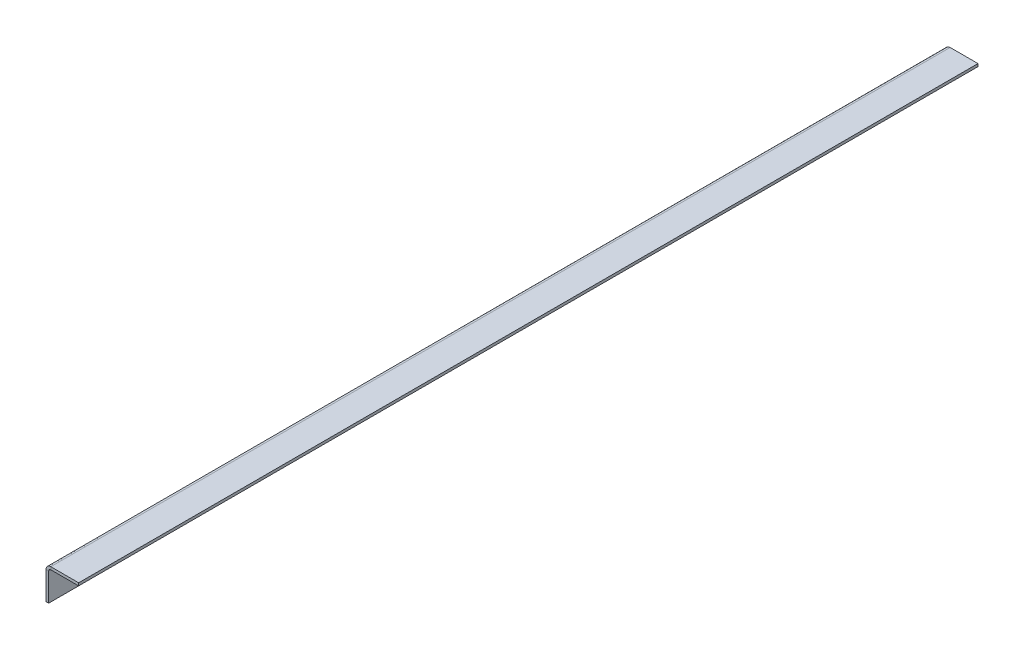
ISO-10303-21;
HEADER;
FILE_DESCRIPTION(('STEP AP214'),'2;1');
FILE_NAME('part.step','',(''),(''),'','','');
FILE_SCHEMA(('AUTOMOTIVE_DESIGN { 1 0 10303 214 1 1 1 1 }'));
ENDSEC;
DATA;
#1=APPLICATION_CONTEXT('core data for automotive mechanical design processes');
#2=APPLICATION_PROTOCOL_DEFINITION('international standard','automotive_design',2000,#1);
#3=PRODUCT_CONTEXT('',#1,'mechanical');
#4=PRODUCT('Part','Part','',(#3));
#5=PRODUCT_RELATED_PRODUCT_CATEGORY('part','',(#4));
#6=PRODUCT_DEFINITION_FORMATION('','',#4);
#7=PRODUCT_DEFINITION_CONTEXT('part definition',#1,'design');
#8=PRODUCT_DEFINITION('design','',#6,#7);
#9=PRODUCT_DEFINITION_SHAPE('','',#8);
#10=(LENGTH_UNIT() NAMED_UNIT(*) SI_UNIT(.MILLI.,.METRE.));
#11=(NAMED_UNIT(*) PLANE_ANGLE_UNIT() SI_UNIT($,.RADIAN.));
#12=(NAMED_UNIT(*) SI_UNIT($,.STERADIAN.) SOLID_ANGLE_UNIT());
#13=UNCERTAINTY_MEASURE_WITH_UNIT(LENGTH_MEASURE(1.E-05),#10,'distance_accuracy_value','');
#14=(GEOMETRIC_REPRESENTATION_CONTEXT(3) GLOBAL_UNCERTAINTY_ASSIGNED_CONTEXT((#13)) GLOBAL_UNIT_ASSIGNED_CONTEXT((#10,
#11,#12)) REPRESENTATION_CONTEXT('',''));
#15=CARTESIAN_POINT('',(0.,0.,0.));
#16=DIRECTION('',(0.,0.,1.));
#17=DIRECTION('',(1.,0.,0.));
#18=AXIS2_PLACEMENT_3D('',#15,#16,#17);
#19=CARTESIAN_POINT('',(0.,47.2186,762.));
#20=DIRECTION('',(0.,0.,1.));
#21=DIRECTION('',(1.,0.,0.));
#22=AXIS2_PLACEMENT_3D('',#19,#20,#21);
#23=PLANE('',#22);
#24=DIRECTION('',(-1.,0.,0.));
#25=VECTOR('',#24,1.);
#26=CARTESIAN_POINT('',(0.,47.2186,762.));
#27=LINE('',#26,#25);
#28=CARTESIAN_POINT('',(0.,47.2186,762.));
#29=VERTEX_POINT('',#28);
#30=CARTESIAN_POINT('',(-4.5466,47.2186,762.));
#31=VERTEX_POINT('',#30);
#32=EDGE_CURVE('E11',#29,#31,#27,.T.);
#33=ORIENTED_EDGE('',*,*,#32,.F.);
#34=CARTESIAN_POINT('',(3.5814,47.2186,762.));
#35=DIRECTION('',(0.,0.,1.));
#36=DIRECTION('',(1.,0.,0.));
#37=AXIS2_PLACEMENT_3D('',#34,#35,#36);
#38=CIRCLE('',#37,3.5814);
#39=CARTESIAN_POINT('',(3.5814,50.8,762.));
#40=VERTEX_POINT('',#39);
#41=EDGE_CURVE('E129',#29,#40,#38,.F.);
#42=ORIENTED_EDGE('',*,*,#41,.T.);
#43=DIRECTION('',(0.,-1.,0.));
#44=VECTOR('',#43,1.);
#45=CARTESIAN_POINT('',(3.5814,55.3466,762.));
#46=LINE('',#45,#44);
#47=CARTESIAN_POINT('',(3.5814,55.3466,762.));
#48=VERTEX_POINT('',#47);
#49=EDGE_CURVE('E47',#48,#40,#46,.T.);
#50=ORIENTED_EDGE('',*,*,#49,.F.);
#51=CARTESIAN_POINT('',(3.5814,47.2186,762.));
#52=DIRECTION('',(0.,0.,1.));
#53=DIRECTION('',(1.,0.,0.));
#54=AXIS2_PLACEMENT_3D('',#51,#52,#53);
#55=CIRCLE('',#54,8.128);
#56=EDGE_CURVE('E136',#31,#48,#55,.F.);
#57=ORIENTED_EDGE('',*,*,#56,.F.);
#58=EDGE_LOOP('',(#33,#42,#50,#57));
#59=FACE_BOUND('',#58,.T.);
#60=ADVANCED_FACE('F39',(#59),#23,.T.);
#61=CARTESIAN_POINT('',(3.5814,55.3466,762.));
#62=DIRECTION('',(0.,0.,1.));
#63=DIRECTION('',(1.,0.,0.));
#64=AXIS2_PLACEMENT_3D('',#61,#62,#63);
#65=PLANE('',#64);
#66=DIRECTION('',(0.,1.,0.));
#67=VECTOR('',#66,1.);
#68=CARTESIAN_POINT('',(0.,0.,762.));
#69=LINE('',#68,#67);
#70=CARTESIAN_POINT('',(0.,0.,762.));
#71=VERTEX_POINT('',#70);
#72=EDGE_CURVE('E124',#71,#29,#69,.T.);
#73=ORIENTED_EDGE('',*,*,#72,.T.);
#74=ORIENTED_EDGE('',*,*,#32,.T.);
#75=DIRECTION('',(0.,1.,0.));
#76=VECTOR('',#75,1.);
#77=CARTESIAN_POINT('',(-4.5466,0.,762.));
#78=LINE('',#77,#76);
#79=CARTESIAN_POINT('',(-4.5466,0.,762.));
#80=VERTEX_POINT('',#79);
#81=EDGE_CURVE('E134',#80,#31,#78,.T.);
#82=ORIENTED_EDGE('',*,*,#81,.F.);
#83=DIRECTION('',(-1.,0.,0.));
#84=VECTOR('',#83,1.);
#85=CARTESIAN_POINT('',(0.,0.,762.));
#86=LINE('',#85,#84);
#87=EDGE_CURVE('E115',#71,#80,#86,.T.);
#88=ORIENTED_EDGE('',*,*,#87,.F.);
#89=EDGE_LOOP('',(#73,#74,#82,#88));
#90=FACE_BOUND('',#89,.T.);
#91=ADVANCED_FACE('F132',(#90),#65,.T.);
#92=CARTESIAN_POINT('',(3.5814,50.8,-762.));
#93=DIRECTION('',(0.,0.,-1.));
#94=DIRECTION('',(-1.,0.,0.));
#95=AXIS2_PLACEMENT_3D('',#92,#93,#94);
#96=PLANE('',#95);
#97=DIRECTION('',(0.,1.,0.));
#98=VECTOR('',#97,1.);
#99=CARTESIAN_POINT('',(3.5814,50.8,-762.));
#100=LINE('',#99,#98);
#101=CARTESIAN_POINT('',(3.5814,50.8,-762.));
#102=VERTEX_POINT('',#101);
#103=CARTESIAN_POINT('',(3.5814,55.3466,-762.));
#104=VERTEX_POINT('',#103);
#105=EDGE_CURVE('E90',#102,#104,#100,.T.);
#106=ORIENTED_EDGE('',*,*,#105,.F.);
#107=CARTESIAN_POINT('',(3.5814,47.2186,-762.));
#108=DIRECTION('',(0.,0.,1.));
#109=DIRECTION('',(1.,0.,0.));
#110=AXIS2_PLACEMENT_3D('',#107,#108,#109);
#111=CIRCLE('',#110,3.5814);
#112=CARTESIAN_POINT('',(0.,47.2186,-762.));
#113=VERTEX_POINT('',#112);
#114=EDGE_CURVE('E158',#113,#102,#111,.F.);
#115=ORIENTED_EDGE('',*,*,#114,.F.);
#116=DIRECTION('',(1.,0.,0.));
#117=VECTOR('',#116,1.);
#118=CARTESIAN_POINT('',(-4.5466,47.2186,-762.));
#119=LINE('',#118,#117);
#120=CARTESIAN_POINT('',(-4.5466,47.2186,-762.));
#121=VERTEX_POINT('',#120);
#122=EDGE_CURVE('E83',#121,#113,#119,.T.);
#123=ORIENTED_EDGE('',*,*,#122,.F.);
#124=CARTESIAN_POINT('',(3.5814,47.2186,-762.));
#125=DIRECTION('',(0.,0.,1.));
#126=DIRECTION('',(1.,0.,0.));
#127=AXIS2_PLACEMENT_3D('',#124,#125,#126);
#128=CIRCLE('',#127,8.128);
#129=EDGE_CURVE('E151',#121,#104,#128,.F.);
#130=ORIENTED_EDGE('',*,*,#129,.T.);
#131=EDGE_LOOP('',(#106,#115,#123,#130));
#132=FACE_BOUND('',#131,.T.);
#133=ADVANCED_FACE('F190',(#132),#96,.T.);
#134=CARTESIAN_POINT('',(-4.5466,47.2186,-762.));
#135=DIRECTION('',(0.,0.,-1.));
#136=DIRECTION('',(-1.,0.,0.));
#137=AXIS2_PLACEMENT_3D('',#134,#135,#136);
#138=PLANE('',#137);
#139=DIRECTION('',(1.,0.,0.));
#140=VECTOR('',#139,1.);
#141=CARTESIAN_POINT('',(0.,50.8,-762.));
#142=LINE('',#141,#140);
#143=CARTESIAN_POINT('',(50.8,50.8,-762.));
#144=VERTEX_POINT('',#143);
#145=EDGE_CURVE('E142',#102,#144,#142,.T.);
#146=ORIENTED_EDGE('',*,*,#145,.F.);
#147=ORIENTED_EDGE('',*,*,#105,.T.);
#148=DIRECTION('',(1.,0.,0.));
#149=VECTOR('',#148,1.);
#150=CARTESIAN_POINT('',(0.,55.3466,-762.));
#151=LINE('',#150,#149);
#152=CARTESIAN_POINT('',(50.8,55.3466,-762.));
#153=VERTEX_POINT('',#152);
#154=EDGE_CURVE('E148',#104,#153,#151,.T.);
#155=ORIENTED_EDGE('',*,*,#154,.T.);
#156=DIRECTION('',(0.,-1.,0.));
#157=VECTOR('',#156,1.);
#158=CARTESIAN_POINT('',(50.8,55.3466,-762.));
#159=LINE('',#158,#157);
#160=EDGE_CURVE('E145',#153,#144,#159,.T.);
#161=ORIENTED_EDGE('',*,*,#160,.T.);
#162=EDGE_LOOP('',(#146,#147,#155,#161));
#163=FACE_BOUND('',#162,.T.);
#164=ADVANCED_FACE('F177',(#163),#138,.T.);
#165=CARTESIAN_POINT('',(0.,50.8,762.));
#166=DIRECTION('',(0.,1.,0.));
#167=DIRECTION('',(0.,0.,1.));
#168=AXIS2_PLACEMENT_3D('',#165,#166,#167);
#169=PLANE('',#168);
#170=ORIENTED_EDGE('',*,*,#145,.T.);
#171=DIRECTION('',(0.,0.,-1.));
#172=VECTOR('',#171,1.);
#173=CARTESIAN_POINT('',(50.8,50.8,762.));
#174=LINE('',#173,#172);
#175=CARTESIAN_POINT('',(50.8,50.8,762.));
#176=VERTEX_POINT('',#175);
#177=EDGE_CURVE('E172',#176,#144,#174,.T.);
#178=ORIENTED_EDGE('',*,*,#177,.F.);
#179=DIRECTION('',(1.,0.,0.));
#180=VECTOR('',#179,1.);
#181=CARTESIAN_POINT('',(0.,50.8,762.));
#182=LINE('',#181,#180);
#183=EDGE_CURVE('E96',#40,#176,#182,.T.);
#184=ORIENTED_EDGE('',*,*,#183,.F.);
#185=DIRECTION('',(0.,0.,-1.));
#186=VECTOR('',#185,1.);
#187=CARTESIAN_POINT('',(3.5814,50.8,762.));
#188=LINE('',#187,#186);
#189=EDGE_CURVE('E141',#40,#102,#188,.T.);
#190=ORIENTED_EDGE('',*,*,#189,.T.);
#191=EDGE_LOOP('',(#170,#178,#184,#190));
#192=FACE_BOUND('',#191,.T.);
#193=ADVANCED_FACE('F226',(#192),#169,.F.);
#194=CARTESIAN_POINT('',(50.8,55.3466,762.));
#195=DIRECTION('',(1.,0.,0.));
#196=DIRECTION('',(0.,0.,-1.));
#197=AXIS2_PLACEMENT_3D('',#194,#195,#196);
#198=PLANE('',#197);
#199=ORIENTED_EDGE('',*,*,#160,.F.);
#200=DIRECTION('',(0.,0.,-1.));
#201=VECTOR('',#200,1.);
#202=CARTESIAN_POINT('',(50.8,55.3466,762.));
#203=LINE('',#202,#201);
#204=CARTESIAN_POINT('',(50.8,55.3466,762.));
#205=VERTEX_POINT('',#204);
#206=EDGE_CURVE('E170',#205,#153,#203,.T.);
#207=ORIENTED_EDGE('',*,*,#206,.F.);
#208=DIRECTION('',(0.,-1.,0.));
#209=VECTOR('',#208,1.);
#210=CARTESIAN_POINT('',(50.8,55.3466,762.));
#211=LINE('',#210,#209);
#212=EDGE_CURVE('E196',#205,#176,#211,.T.);
#213=ORIENTED_EDGE('',*,*,#212,.T.);
#214=ORIENTED_EDGE('',*,*,#177,.T.);
#215=EDGE_LOOP('',(#199,#207,#213,#214));
#216=FACE_BOUND('',#215,.T.);
#217=ADVANCED_FACE('F202',(#216),#198,.T.);
#218=CARTESIAN_POINT('',(0.,55.3466,762.));
#219=DIRECTION('',(0.,1.,0.));
#220=DIRECTION('',(0.,0.,1.));
#221=AXIS2_PLACEMENT_3D('',#218,#219,#220);
#222=PLANE('',#221);
#223=ORIENTED_EDGE('',*,*,#154,.F.);
#224=DIRECTION('',(0.,0.,-1.));
#225=VECTOR('',#224,1.);
#226=CARTESIAN_POINT('',(3.5814,55.3466,762.));
#227=LINE('',#226,#225);
#228=EDGE_CURVE('E167',#48,#104,#227,.T.);
#229=ORIENTED_EDGE('',*,*,#228,.F.);
#230=DIRECTION('',(1.,0.,0.));
#231=VECTOR('',#230,1.);
#232=CARTESIAN_POINT('',(0.,55.3466,762.));
#233=LINE('',#232,#231);
#234=EDGE_CURVE('E195',#48,#205,#233,.T.);
#235=ORIENTED_EDGE('',*,*,#234,.T.);
#236=ORIENTED_EDGE('',*,*,#206,.T.);
#237=EDGE_LOOP('',(#223,#229,#235,#236));
#238=FACE_BOUND('',#237,.T.);
#239=ADVANCED_FACE('F188',(#238),#222,.T.);
#240=CARTESIAN_POINT('',(3.5814,47.2186,762.));
#241=DIRECTION('',(0.,0.,-1.));
#242=DIRECTION('',(-1.,0.,0.));
#243=AXIS2_PLACEMENT_3D('',#240,#241,#242);
#244=CYLINDRICAL_SURFACE('',#243,8.128);
#245=ORIENTED_EDGE('',*,*,#129,.F.);
#246=DIRECTION('',(0.,0.,-1.));
#247=VECTOR('',#246,1.);
#248=CARTESIAN_POINT('',(-4.5466,47.2186,762.));
#249=LINE('',#248,#247);
#250=EDGE_CURVE('E164',#31,#121,#249,.T.);
#251=ORIENTED_EDGE('',*,*,#250,.F.);
#252=ORIENTED_EDGE('',*,*,#56,.T.);
#253=ORIENTED_EDGE('',*,*,#228,.T.);
#254=EDGE_LOOP('',(#245,#251,#252,#253));
#255=FACE_BOUND('',#254,.T.);
#256=ADVANCED_FACE('F183',(#255),#244,.T.);
#257=CARTESIAN_POINT('',(-4.5466,0.,762.));
#258=DIRECTION('',(-1.,0.,0.));
#259=DIRECTION('',(0.,0.,1.));
#260=AXIS2_PLACEMENT_3D('',#257,#258,#259);
#261=PLANE('',#260);
#262=DIRECTION('',(0.,1.,0.));
#263=VECTOR('',#262,1.);
#264=CARTESIAN_POINT('',(-4.5466,0.,-762.));
#265=LINE('',#264,#263);
#266=CARTESIAN_POINT('',(-4.5466,0.,-762.));
#267=VERTEX_POINT('',#266);
#268=EDGE_CURVE('E153',#267,#121,#265,.T.);
#269=ORIENTED_EDGE('',*,*,#268,.F.);
#270=DIRECTION('',(0.,0.,-1.));
#271=VECTOR('',#270,1.);
#272=CARTESIAN_POINT('',(-4.5466,0.,762.));
#273=LINE('',#272,#271);
#274=EDGE_CURVE('E119',#80,#267,#273,.T.);
#275=ORIENTED_EDGE('',*,*,#274,.F.);
#276=ORIENTED_EDGE('',*,*,#81,.T.);
#277=ORIENTED_EDGE('',*,*,#250,.T.);
#278=EDGE_LOOP('',(#269,#275,#276,#277));
#279=FACE_BOUND('',#278,.T.);
#280=ADVANCED_FACE('F193',(#279),#261,.T.);
#281=CARTESIAN_POINT('',(0.,0.,762.));
#282=DIRECTION('',(0.,-1.,0.));
#283=DIRECTION('',(0.,0.,-1.));
#284=AXIS2_PLACEMENT_3D('',#281,#282,#283);
#285=PLANE('',#284);
#286=DIRECTION('',(-1.,0.,0.));
#287=VECTOR('',#286,1.);
#288=CARTESIAN_POINT('',(0.,0.,-762.));
#289=LINE('',#288,#287);
#290=CARTESIAN_POINT('',(0.,0.,-762.));
#291=VERTEX_POINT('',#290);
#292=EDGE_CURVE('E117',#291,#267,#289,.T.);
#293=ORIENTED_EDGE('',*,*,#292,.F.);
#294=DIRECTION('',(0.,0.,-1.));
#295=VECTOR('',#294,1.);
#296=CARTESIAN_POINT('',(0.,0.,762.));
#297=LINE('',#296,#295);
#298=EDGE_CURVE('E111',#71,#291,#297,.T.);
#299=ORIENTED_EDGE('',*,*,#298,.F.);
#300=ORIENTED_EDGE('',*,*,#87,.T.);
#301=ORIENTED_EDGE('',*,*,#274,.T.);
#302=EDGE_LOOP('',(#293,#299,#300,#301));
#303=FACE_BOUND('',#302,.T.);
#304=ADVANCED_FACE('F113',(#303),#285,.T.);
#305=CARTESIAN_POINT('',(0.,0.,762.));
#306=DIRECTION('',(-1.,0.,0.));
#307=DIRECTION('',(0.,0.,1.));
#308=AXIS2_PLACEMENT_3D('',#305,#306,#307);
#309=PLANE('',#308);
#310=DIRECTION('',(0.,1.,0.));
#311=VECTOR('',#310,1.);
#312=CARTESIAN_POINT('',(0.,0.,-762.));
#313=LINE('',#312,#311);
#314=EDGE_CURVE('E156',#291,#113,#313,.T.);
#315=ORIENTED_EDGE('',*,*,#314,.T.);
#316=DIRECTION('',(0.,0.,-1.));
#317=VECTOR('',#316,1.);
#318=CARTESIAN_POINT('',(0.,47.2186,762.));
#319=LINE('',#318,#317);
#320=EDGE_CURVE('E120',#29,#113,#319,.T.);
#321=ORIENTED_EDGE('',*,*,#320,.F.);
#322=ORIENTED_EDGE('',*,*,#72,.F.);
#323=ORIENTED_EDGE('',*,*,#298,.T.);
#324=EDGE_LOOP('',(#315,#321,#322,#323));
#325=FACE_BOUND('',#324,.T.);
#326=ADVANCED_FACE('F125',(#325),#309,.F.);
#327=CARTESIAN_POINT('',(3.5814,47.2186,762.));
#328=DIRECTION('',(0.,0.,-1.));
#329=DIRECTION('',(-1.,0.,0.));
#330=AXIS2_PLACEMENT_3D('',#327,#328,#329);
#331=CYLINDRICAL_SURFACE('',#330,3.5814);
#332=ORIENTED_EDGE('',*,*,#114,.T.);
#333=ORIENTED_EDGE('',*,*,#189,.F.);
#334=ORIENTED_EDGE('',*,*,#41,.F.);
#335=ORIENTED_EDGE('',*,*,#320,.T.);
#336=EDGE_LOOP('',(#332,#333,#334,#335));
#337=FACE_BOUND('',#336,.T.);
#338=ADVANCED_FACE('F206',(#337),#331,.F.);
#339=CARTESIAN_POINT('',(3.5814,47.2186,762.));
#340=DIRECTION('',(0.,0.,1.));
#341=DIRECTION('',(1.,0.,0.));
#342=AXIS2_PLACEMENT_3D('',#339,#340,#341);
#343=PLANE('',#342);
#344=ORIENTED_EDGE('',*,*,#183,.T.);
#345=ORIENTED_EDGE('',*,*,#212,.F.);
#346=ORIENTED_EDGE('',*,*,#234,.F.);
#347=ORIENTED_EDGE('',*,*,#49,.T.);
#348=EDGE_LOOP('',(#344,#345,#346,#347));
#349=FACE_BOUND('',#348,.T.);
#350=ADVANCED_FACE('F203',(#349),#343,.T.);
#351=CARTESIAN_POINT('',(3.5814,47.2186,-762.));
#352=DIRECTION('',(0.,0.,1.));
#353=DIRECTION('',(1.,0.,0.));
#354=AXIS2_PLACEMENT_3D('',#351,#352,#353);
#355=PLANE('',#354);
#356=ORIENTED_EDGE('',*,*,#268,.T.);
#357=ORIENTED_EDGE('',*,*,#122,.T.);
#358=ORIENTED_EDGE('',*,*,#314,.F.);
#359=ORIENTED_EDGE('',*,*,#292,.T.);
#360=EDGE_LOOP('',(#356,#357,#358,#359));
#361=FACE_BOUND('',#360,.T.);
#362=ADVANCED_FACE('F205',(#361),#355,.F.);
#363=CLOSED_SHELL('',(#60,#91,#133,#164,#193,#217,#239,#256,#280,#304,#326,#338,#350,#362));
#364=MANIFOLD_SOLID_BREP('B2',#363);
#365=ADVANCED_BREP_SHAPE_REPRESENTATION('',(#18,#364),#14);
#366=SHAPE_DEFINITION_REPRESENTATION(#9,#365);
ENDSEC;
END-ISO-10303-21;
